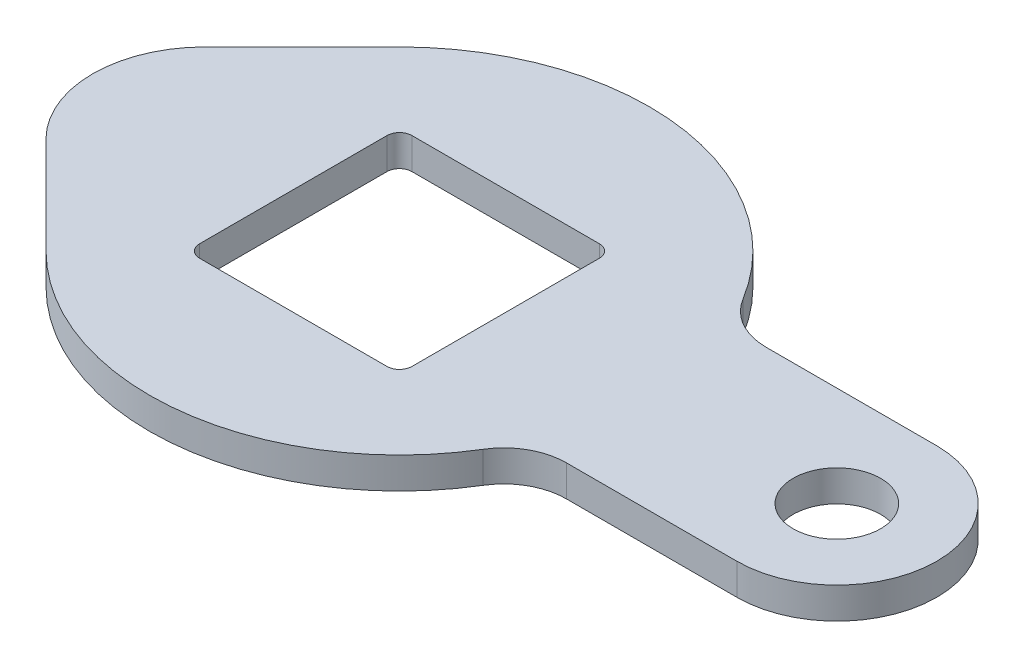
from build123d import *

# Parameters (mm, degrees)
SKETCH_1_R      = 3.5
EXTRUDE_1_DEPTH = 2.5


with BuildPart() as part:
    # Sketch 1 → Extrude 1 (new body)
    with BuildSketch(Plane(origin=(0, 0, 0), x_dir=(1, 0, 0), z_dir=(0, 1, 0))):
        with BuildLine():
            Line((-14.142135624, 14.142135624), (-21.920310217, 6.363961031))
            ThreePointArc((-21.920310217, 6.363961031), (-24.556349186, 0), (-21.920310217, -6.363961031))
            Line((-21.920310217, -6.363961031), (-14.142135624, -14.142135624))
            ThreePointArc((-14.142135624, -14.142135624), (2.379820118, -19.857906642), (17.083325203, -10.4))
            ThreePointArc((17.083325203, -10.4), (18.904666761, -8.641101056), (21.354156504, -8))
            Line((21.354156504, -8), (35, -8))
            ThreePointArc((35, -8), (43, 0), (35, 8))
            Line((35, 8), (21.354156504, 8))
            ThreePointArc((21.354156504, 8), (18.904666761, 8.641101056), (17.083325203, 10.4))
            ThreePointArc((17.083325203, 10.4), (2.379820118, 19.857906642), (-14.142135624, 14.142135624))
        make_face()
        with Locations(Location((35, 0, 0), (0, 0, 270))):
            Circle(SKETCH_1_R, mode=Mode.SUBTRACT)
        with BuildLine():
            Line((-7.5, 8.5), (7.5, 8.5))
            ThreePointArc((7.5, 8.5), (8.207106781, 8.207106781), (8.5, 7.5))
            Line((8.5, 7.5), (8.5, -7.5))
            ThreePointArc((8.5, -7.5), (8.207106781, -8.207106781), (7.5, -8.5))
            Line((7.5, -8.5), (-7.5, -8.5))
            ThreePointArc((-7.5, -8.5), (-8.207106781, -8.207106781), (-8.5, -7.5))
            Line((-8.5, -7.5), (-8.5, 7.5))
            ThreePointArc((-8.5, 7.5), (-8.207106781, 8.207106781), (-7.5, 8.5))
        make_face(mode=Mode.SUBTRACT)
    extrude(amount=-EXTRUDE_1_DEPTH)


solid = part.part
